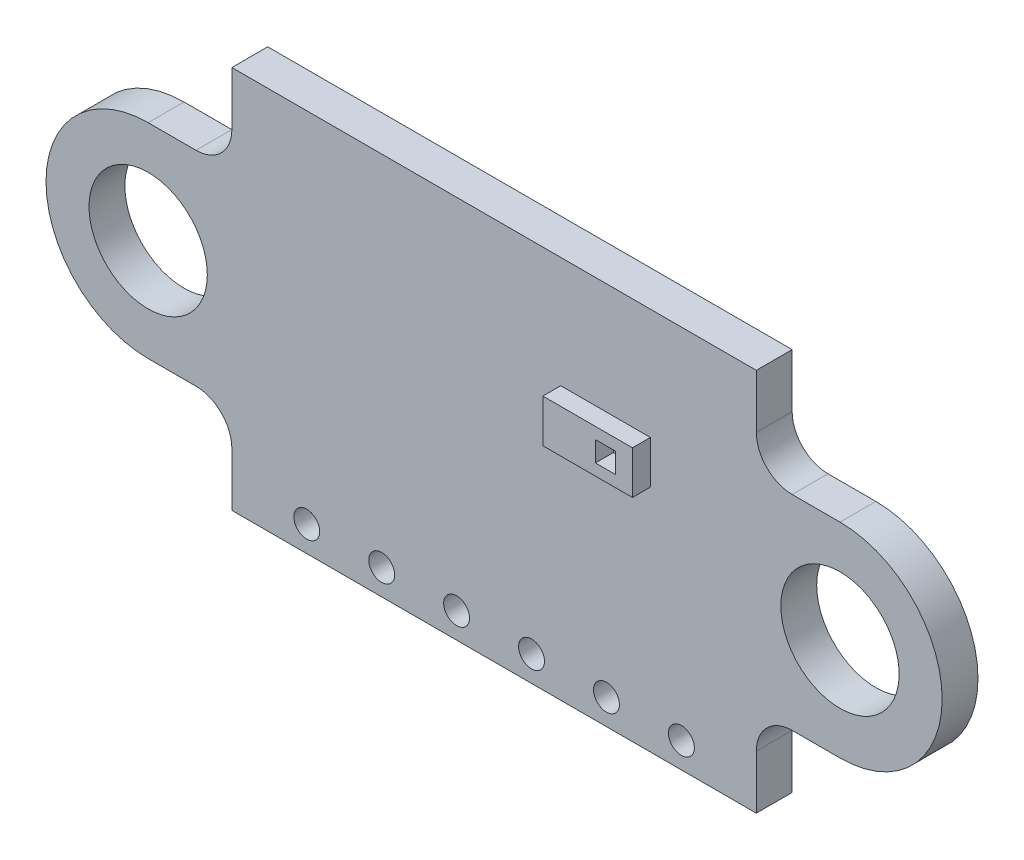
from build123d import *

# Parameters (mm, degrees)
SKETCH_1_R      = 1.65
SKETCH_1_R_2    = 0.361463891
EXTRUDE_1_DEPTH = 1
SKETCH_2_W      = 2.5
SKETCH_2_H      = 1.200470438
SKETCH_2_W_2    = 0.563931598
SKETCH_2_H_2    = 0.563931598
EXTRUDE_2_DEPTH = 0.5


with BuildPart() as part:
    # Sketch 1 → Extrude 1 (new body)
    with BuildSketch(Plane.XY):
        with BuildLine():
            Line((-7.315587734, 5.35), (7.315587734, 5.35))
            Line((7.315587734, 5.35), (7.315587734, 3.85))
            ThreePointArc((7.315587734, 3.85), (7.608480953, 3.142893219), (8.315587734, 2.85))
            Line((8.315587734, 2.85), (9.65, 2.85))
            ThreePointArc((9.65, 2.85), (12.5, 0), (9.65, -2.85))
            Line((9.65, -2.85), (8.315587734, -2.85))
            ThreePointArc((8.315587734, -2.85), (7.608480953, -3.142893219), (7.315587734, -3.85))
            Line((7.315587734, -3.85), (7.315587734, -5.35))
            Line((7.315587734, -5.35), (-7.315587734, -5.35))
            Line((-7.315587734, -5.35), (-7.315587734, -3.85))
            ThreePointArc((-7.315587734, -3.85), (-7.608480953, -3.142893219), (-8.315587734, -2.85))
            Line((-8.315587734, -2.85), (-9.65, -2.85))
            ThreePointArc((-9.65, -2.85), (-12.5, 0), (-9.65, 2.85))
            Line((-9.65, 2.85), (-8.315587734, 2.85))
            ThreePointArc((-8.315587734, 2.85), (-7.608480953, 3.142893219), (-7.315587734, 3.85))
            Line((-7.315587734, 3.85), (-7.315587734, 5.35))
        make_face()
        with Locations((-9.65, 0)):
            Circle(SKETCH_1_R, mode=Mode.SUBTRACT)
        with Locations(Location((9.65, 0, 0), (0, 0, 180))):
            Circle(SKETCH_1_R, mode=Mode.SUBTRACT)
        with Locations((-5.22541981, -4.637777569)):
            Circle(SKETCH_1_R_2, mode=Mode.SUBTRACT)
        with Locations((-3.135251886, -4.637777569)):
            Circle(SKETCH_1_R_2, mode=Mode.SUBTRACT)
        with Locations((-1.045083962, -4.637777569)):
            Circle(SKETCH_1_R_2, mode=Mode.SUBTRACT)
        with Locations(Location((1.045083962, -4.637777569, 0), (0, 0, 180))):
            Circle(SKETCH_1_R_2, mode=Mode.SUBTRACT)
        with Locations(Location((3.135251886, -4.637777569, 0), (0, 0, 180))):
            Circle(SKETCH_1_R_2, mode=Mode.SUBTRACT)
        with Locations(Location((5.22541981, -4.637777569, 0), (0, 0, 180))):
            Circle(SKETCH_1_R_2, mode=Mode.SUBTRACT)
    extrude(amount=EXTRUDE_1_DEPTH)

    # Sketch 2 → Extrude 2 (add)
    with BuildSketch(Plane.XY.offset(1)):
        with Locations((3.11, 1.65)):
            Rectangle(SKETCH_2_W, SKETCH_2_H)
        with Locations((3.61, 1.65)):
            Rectangle(SKETCH_2_W_2, SKETCH_2_H_2, mode=Mode.SUBTRACT)
    extrude(amount=EXTRUDE_2_DEPTH)


solid = part.part
